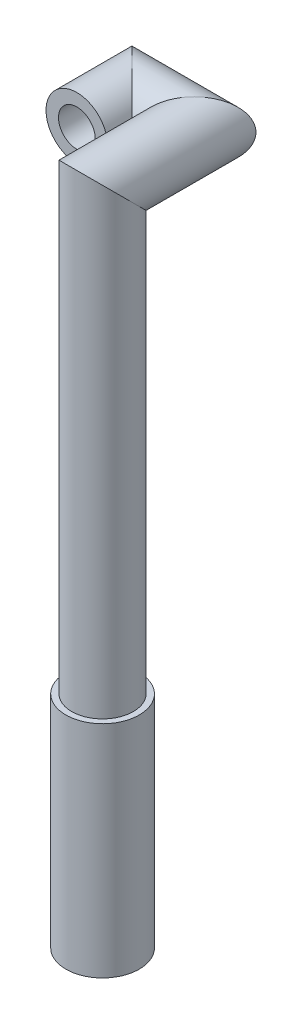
ISO-10303-21;
HEADER;
FILE_DESCRIPTION(('STEP AP214'),'2;1');
FILE_NAME('part.step','',(''),(''),'','','');
FILE_SCHEMA(('AUTOMOTIVE_DESIGN { 1 0 10303 214 1 1 1 1 }'));
ENDSEC;
DATA;
#1=APPLICATION_CONTEXT('core data for automotive mechanical design processes');
#2=APPLICATION_PROTOCOL_DEFINITION('international standard','automotive_design',2000,#1);
#3=PRODUCT_CONTEXT('',#1,'mechanical');
#4=PRODUCT('Part','Part','',(#3));
#5=PRODUCT_RELATED_PRODUCT_CATEGORY('part','',(#4));
#6=PRODUCT_DEFINITION_FORMATION('','',#4);
#7=PRODUCT_DEFINITION_CONTEXT('part definition',#1,'design');
#8=PRODUCT_DEFINITION('design','',#6,#7);
#9=PRODUCT_DEFINITION_SHAPE('','',#8);
#10=(LENGTH_UNIT() NAMED_UNIT(*) SI_UNIT(.MILLI.,.METRE.));
#11=(NAMED_UNIT(*) PLANE_ANGLE_UNIT() SI_UNIT($,.RADIAN.));
#12=(NAMED_UNIT(*) SI_UNIT($,.STERADIAN.) SOLID_ANGLE_UNIT());
#13=UNCERTAINTY_MEASURE_WITH_UNIT(LENGTH_MEASURE(1.E-05),#10,'distance_accuracy_value','');
#14=(GEOMETRIC_REPRESENTATION_CONTEXT(3) GLOBAL_UNCERTAINTY_ASSIGNED_CONTEXT((#13)) GLOBAL_UNIT_ASSIGNED_CONTEXT((#10,
#11,#12)) REPRESENTATION_CONTEXT('',''));
#15=CARTESIAN_POINT('',(0.,0.,0.));
#16=DIRECTION('',(0.,0.,1.));
#17=DIRECTION('',(1.,0.,0.));
#18=AXIS2_PLACEMENT_3D('',#15,#16,#17);
#19=CARTESIAN_POINT('',(0.,38.1,0.));
#20=DIRECTION('',(0.,-1.,0.));
#21=DIRECTION('',(0.,0.,-1.));
#22=AXIS2_PLACEMENT_3D('',#19,#20,#21);
#23=CYLINDRICAL_SURFACE('',#22,6.35);
#24=CARTESIAN_POINT('',(0.,-12.7,0.));
#25=DIRECTION('',(0.,-1.,0.));
#26=DIRECTION('',(0.,0.,-1.));
#27=AXIS2_PLACEMENT_3D('',#24,#25,#26);
#28=CIRCLE('',#27,6.35);
#29=CARTESIAN_POINT('',(0.,-12.7,-6.35));
#30=VERTEX_POINT('',#29);
#31=EDGE_CURVE('E35',#30,#30,#28,.T.);
#32=ORIENTED_EDGE('',*,*,#31,.T.);
#33=EDGE_LOOP('',(#32));
#34=FACE_BOUND('',#33,.T.);
#35=CARTESIAN_POINT('',(0.,190.5,0.));
#36=DIRECTION('',(0.,0.707106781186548,-0.707106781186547));
#37=DIRECTION('',(0.,0.707106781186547,0.707106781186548));
#38=AXIS2_PLACEMENT_3D('',#35,#36,#37);
#39=ELLIPSE('',#38,8.98025612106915,6.35);
#40=CARTESIAN_POINT('',(0.,196.85,6.35000000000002));
#41=VERTEX_POINT('',#40);
#42=EDGE_CURVE('E52',#41,#41,#39,.T.);
#43=ORIENTED_EDGE('',*,*,#42,.T.);
#44=EDGE_LOOP('',(#43));
#45=FACE_BOUND('',#44,.T.);
#46=ADVANCED_FACE('F31',(#34,#45),#23,.F.);
#47=CARTESIAN_POINT('',(0.,38.1,0.));
#48=DIRECTION('',(0.,1.,0.));
#49=DIRECTION('',(0.,0.,1.));
#50=AXIS2_PLACEMENT_3D('',#47,#48,#49);
#51=PLANE('',#50);
#52=CARTESIAN_POINT('',(0.,38.1,0.));
#53=DIRECTION('',(0.,1.,0.));
#54=DIRECTION('',(0.,0.,1.));
#55=AXIS2_PLACEMENT_3D('',#52,#53,#54);
#56=CIRCLE('',#55,10.668);
#57=CARTESIAN_POINT('',(0.,38.1,10.668));
#58=VERTEX_POINT('',#57);
#59=EDGE_CURVE('E39',#58,#58,#56,.T.);
#60=ORIENTED_EDGE('',*,*,#59,.F.);
#61=EDGE_LOOP('',(#60));
#62=FACE_BOUND('',#61,.T.);
#63=CARTESIAN_POINT('',(0.,38.1,0.));
#64=DIRECTION('',(0.,1.,0.));
#65=DIRECTION('',(0.,0.,1.));
#66=AXIS2_PLACEMENT_3D('',#63,#64,#65);
#67=CIRCLE('',#66,12.7);
#68=CARTESIAN_POINT('',(0.,38.1,-12.7));
#69=VERTEX_POINT('',#68);
#70=EDGE_CURVE('E10',#69,#69,#67,.T.);
#71=ORIENTED_EDGE('',*,*,#70,.T.);
#72=EDGE_LOOP('',(#71));
#73=FACE_BOUND('',#72,.T.);
#74=ADVANCED_FACE('F122',(#62,#73),#51,.T.);
#75=CARTESIAN_POINT('',(0.,38.1,0.));
#76=DIRECTION('',(0.,-1.,0.));
#77=DIRECTION('',(0.,0.,-1.));
#78=AXIS2_PLACEMENT_3D('',#75,#76,#77);
#79=CYLINDRICAL_SURFACE('',#78,12.7);
#80=CARTESIAN_POINT('',(0.,-38.1,0.));
#81=DIRECTION('',(0.,1.,0.));
#82=DIRECTION('',(0.,0.,1.));
#83=AXIS2_PLACEMENT_3D('',#80,#81,#82);
#84=CIRCLE('',#83,12.7);
#85=CARTESIAN_POINT('',(0.,-38.1,-12.7));
#86=VERTEX_POINT('',#85);
#87=EDGE_CURVE('E43',#86,#86,#84,.T.);
#88=CARTESIAN_POINT('',(0.,38.1,-12.7));
#89=CARTESIAN_POINT('',(0.,37.30625,-12.7));
#90=CARTESIAN_POINT('',(0.,36.5125,-12.7));
#91=CARTESIAN_POINT('',(0.,34.925,-12.7));
#92=CARTESIAN_POINT('',(0.,34.13125,-12.7));
#93=CARTESIAN_POINT('',(0.,32.54375,-12.7));
#94=CARTESIAN_POINT('',(0.,31.75,-12.7));
#95=CARTESIAN_POINT('',(0.,30.1625,-12.7));
#96=CARTESIAN_POINT('',(0.,29.36875,-12.7));
#97=CARTESIAN_POINT('',(0.,27.78125,-12.7));
#98=CARTESIAN_POINT('',(0.,26.9875,-12.7));
#99=CARTESIAN_POINT('',(0.,25.4,-12.7));
#100=CARTESIAN_POINT('',(0.,24.60625,-12.7));
#101=CARTESIAN_POINT('',(0.,23.01875,-12.7));
#102=CARTESIAN_POINT('',(0.,22.225,-12.7));
#103=CARTESIAN_POINT('',(0.,20.6375,-12.7));
#104=CARTESIAN_POINT('',(0.,19.84375,-12.7));
#105=CARTESIAN_POINT('',(0.,18.25625,-12.7));
#106=CARTESIAN_POINT('',(0.,17.4625,-12.7));
#107=CARTESIAN_POINT('',(0.,15.875,-12.7));
#108=CARTESIAN_POINT('',(0.,15.08125,-12.7));
#109=CARTESIAN_POINT('',(0.,13.49375,-12.7));
#110=CARTESIAN_POINT('',(0.,12.7,-12.7));
#111=CARTESIAN_POINT('',(0.,11.1125,-12.7));
#112=CARTESIAN_POINT('',(0.,10.31875,-12.7));
#113=CARTESIAN_POINT('',(0.,8.73124999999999,-12.7));
#114=CARTESIAN_POINT('',(0.,7.93749999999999,-12.7));
#115=CARTESIAN_POINT('',(0.,6.34999999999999,-12.7));
#116=CARTESIAN_POINT('',(0.,5.55625,-12.7));
#117=CARTESIAN_POINT('',(0.,3.96875,-12.7));
#118=CARTESIAN_POINT('',(0.,3.17499999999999,-12.7));
#119=CARTESIAN_POINT('',(0.,1.58749999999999,-12.7));
#120=CARTESIAN_POINT('',(0.,0.793749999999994,-12.7));
#121=CARTESIAN_POINT('',(0.,-0.793750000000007,-12.7));
#122=CARTESIAN_POINT('',(0.,-1.58750000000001,-12.7));
#123=CARTESIAN_POINT('',(0.,-3.17500000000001,-12.7));
#124=CARTESIAN_POINT('',(0.,-3.96875000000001,-12.7));
#125=CARTESIAN_POINT('',(0.,-5.55625000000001,-12.7));
#126=CARTESIAN_POINT('',(0.,-6.35000000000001,-12.7));
#127=CARTESIAN_POINT('',(0.,-7.93750000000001,-12.7));
#128=CARTESIAN_POINT('',(0.,-8.73125000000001,-12.7));
#129=CARTESIAN_POINT('',(0.,-10.31875,-12.7));
#130=CARTESIAN_POINT('',(0.,-11.1125,-12.7));
#131=CARTESIAN_POINT('',(0.,-12.7,-12.7));
#132=CARTESIAN_POINT('',(0.,-13.49375,-12.7));
#133=CARTESIAN_POINT('',(0.,-15.08125,-12.7));
#134=CARTESIAN_POINT('',(0.,-15.875,-12.7));
#135=CARTESIAN_POINT('',(0.,-17.4625,-12.7));
#136=CARTESIAN_POINT('',(0.,-18.25625,-12.7));
#137=CARTESIAN_POINT('',(0.,-19.84375,-12.7));
#138=CARTESIAN_POINT('',(0.,-20.6375,-12.7));
#139=CARTESIAN_POINT('',(0.,-22.225,-12.7));
#140=CARTESIAN_POINT('',(0.,-23.01875,-12.7));
#141=CARTESIAN_POINT('',(0.,-24.60625,-12.7));
#142=CARTESIAN_POINT('',(0.,-25.4,-12.7));
#143=CARTESIAN_POINT('',(0.,-26.9875,-12.7));
#144=CARTESIAN_POINT('',(0.,-27.78125,-12.7));
#145=CARTESIAN_POINT('',(0.,-29.36875,-12.7));
#146=CARTESIAN_POINT('',(0.,-30.1625,-12.7));
#147=CARTESIAN_POINT('',(0.,-31.75,-12.7));
#148=CARTESIAN_POINT('',(0.,-32.54375,-12.7));
#149=CARTESIAN_POINT('',(0.,-34.13125,-12.7));
#150=CARTESIAN_POINT('',(0.,-34.925,-12.7));
#151=CARTESIAN_POINT('',(0.,-36.5125,-12.7));
#152=CARTESIAN_POINT('',(0.,-37.30625,-12.7));
#153=CARTESIAN_POINT('',(0.,-38.1,-12.7));
#154=B_SPLINE_CURVE_WITH_KNOTS('',3,(#88,#89,#90,#91,#92,#93,#94,#95,#96,#97,#98,#99,#100,#101,
#102,#103,#104,#105,#106,#107,#108,#109,#110,#111,#112,#113,#114,#115,#116,#117,#118,#119,#120,
#121,#122,#123,#124,#125,#126,#127,#128,#129,#130,#131,#132,#133,#134,#135,#136,#137,#138,#139,
#140,#141,#142,#143,#144,#145,#146,#147,#148,#149,#150,#151,#152,#153),.UNSPECIFIED.,.F.,.F.,(4,
2,2,2,2,2,2,2,2,2,2,2,2,2,2,2,2,2,2,2,2,2,2,2,2,2,2,2,2,2,2,2,4),(0.,2.38124999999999,4.7625,
7.14375,9.525,11.90625,14.2875,16.66875,19.05,21.43125,23.8125,26.19375,28.575,30.95625,33.3375,
35.71875,38.1,40.48125,42.8625,45.24375,47.625,50.00625,52.3875,54.76875,57.15,59.53125,61.9125,
64.29375,66.675,69.05625,71.4375,73.81875,76.2),.UNSPECIFIED.);
#155=EDGE_CURVE('BSEAM33',#69,#86,#154,.T.);
#156=ORIENTED_EDGE('',*,*,#70,.F.);
#157=ORIENTED_EDGE('',*,*,#87,.T.);
#158=ORIENTED_EDGE('',*,*,#155,.T.);
#159=ORIENTED_EDGE('',*,*,#155,.F.);
#160=EDGE_LOOP('',(#156,#158,#157,#159));
#161=FACE_BOUND('',#160,.T.);
#162=ADVANCED_FACE('F33',(#161),#79,.T.);
#163=CARTESIAN_POINT('',(0.,-38.1,0.));
#164=DIRECTION('',(0.,-1.,0.));
#165=DIRECTION('',(0.,0.,1.));
#166=AXIS2_PLACEMENT_3D('',#163,#164,#165);
#167=PLANE('',#166);
#168=CARTESIAN_POINT('',(0.,-38.1,0.));
#169=DIRECTION('',(0.,1.,0.));
#170=DIRECTION('',(0.,0.,1.));
#171=AXIS2_PLACEMENT_3D('',#168,#169,#170);
#172=CIRCLE('',#171,10.668);
#173=CARTESIAN_POINT('',(0.,-38.1,10.668));
#174=VERTEX_POINT('',#173);
#175=EDGE_CURVE('E48',#174,#174,#172,.T.);
#176=ORIENTED_EDGE('',*,*,#175,.T.);
#177=EDGE_LOOP('',(#176));
#178=FACE_BOUND('',#177,.T.);
#179=ORIENTED_EDGE('',*,*,#87,.F.);
#180=EDGE_LOOP('',(#179));
#181=FACE_BOUND('',#180,.T.);
#182=ADVANCED_FACE('F132',(#178,#181),#167,.T.);
#183=CARTESIAN_POINT('',(0.,-12.7,0.));
#184=DIRECTION('',(0.,-1.,0.));
#185=DIRECTION('',(0.,0.,-1.));
#186=AXIS2_PLACEMENT_3D('',#183,#184,#185);
#187=CYLINDRICAL_SURFACE('',#186,10.668);
#188=CARTESIAN_POINT('',(0.,-12.7,0.));
#189=DIRECTION('',(0.,1.,0.));
#190=DIRECTION('',(0.,0.,1.));
#191=AXIS2_PLACEMENT_3D('',#188,#189,#190);
#192=CIRCLE('',#191,10.668);
#193=CARTESIAN_POINT('',(0.,-12.7,10.668));
#194=VERTEX_POINT('',#193);
#195=EDGE_CURVE('E51',#194,#194,#192,.T.);
#196=ORIENTED_EDGE('',*,*,#195,.T.);
#197=EDGE_LOOP('',(#196));
#198=FACE_BOUND('',#197,.T.);
#199=ORIENTED_EDGE('',*,*,#175,.F.);
#200=EDGE_LOOP('',(#199));
#201=FACE_BOUND('',#200,.T.);
#202=ADVANCED_FACE('F135',(#198,#201),#187,.F.);
#203=CARTESIAN_POINT('',(0.,-12.7,0.));
#204=DIRECTION('',(0.,-1.,0.));
#205=DIRECTION('',(0.,0.,1.));
#206=AXIS2_PLACEMENT_3D('',#203,#204,#205);
#207=PLANE('',#206);
#208=ORIENTED_EDGE('',*,*,#31,.F.);
#209=EDGE_LOOP('',(#208));
#210=FACE_BOUND('',#209,.T.);
#211=ORIENTED_EDGE('',*,*,#195,.F.);
#212=EDGE_LOOP('',(#211));
#213=FACE_BOUND('',#212,.T.);
#214=ADVANCED_FACE('F117',(#210,#213),#207,.T.);
#215=CARTESIAN_POINT('',(0.,-17.4736605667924,0.));
#216=DIRECTION('',(0.,1.,0.));
#217=DIRECTION('',(0.,0.,1.));
#218=AXIS2_PLACEMENT_3D('',#215,#216,#217);
#219=CYLINDRICAL_SURFACE('',#218,10.668);
#220=ORIENTED_EDGE('',*,*,#59,.T.);
#221=EDGE_LOOP('',(#220));
#222=FACE_BOUND('',#221,.T.);
#223=CARTESIAN_POINT('',(0.,190.5,0.));
#224=DIRECTION('',(0.,0.707106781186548,-0.707106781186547));
#225=DIRECTION('',(0.,0.707106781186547,0.707106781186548));
#226=AXIS2_PLACEMENT_3D('',#223,#224,#225);
#227=ELLIPSE('',#226,15.0868302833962,10.668);
#228=CARTESIAN_POINT('',(0.,201.168,10.668));
#229=VERTEX_POINT('',#228);
#230=EDGE_CURVE('E61',#229,#229,#227,.F.);
#231=ORIENTED_EDGE('',*,*,#230,.T.);
#232=EDGE_LOOP('',(#231));
#233=FACE_BOUND('',#232,.T.);
#234=ADVANCED_FACE('F85',(#222,#233),#219,.T.);
#235=CARTESIAN_POINT('',(-21.59,190.5,-55.3196));
#236=DIRECTION('',(0.,0.,1.));
#237=DIRECTION('',(1.,0.,0.));
#238=AXIS2_PLACEMENT_3D('',#235,#236,#237);
#239=CYLINDRICAL_SURFACE('',#238,10.668);
#240=CARTESIAN_POINT('',(-21.59,190.5,-31.75));
#241=DIRECTION('',(-0.707106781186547,0.,0.707106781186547));
#242=DIRECTION('',(-0.707106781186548,0.,-0.707106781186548));
#243=AXIS2_PLACEMENT_3D('',#240,#241,#242);
#244=ELLIPSE('',#243,15.0868302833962,10.668);
#245=CARTESIAN_POINT('',(-32.258,190.5,-42.418));
#246=VERTEX_POINT('',#245);
#247=EDGE_CURVE('E55',#246,#246,#244,.F.);
#248=ORIENTED_EDGE('',*,*,#247,.F.);
#249=EDGE_LOOP('',(#248));
#250=FACE_BOUND('',#249,.T.);
#251=CARTESIAN_POINT('',(-21.59,190.5,-12.7));
#252=DIRECTION('',(0.,0.,1.));
#253=DIRECTION('',(0.,1.,0.));
#254=AXIS2_PLACEMENT_3D('',#251,#252,#253);
#255=CIRCLE('',#254,10.668);
#256=CARTESIAN_POINT('',(-21.59,201.168,-12.7));
#257=VERTEX_POINT('',#256);
#258=EDGE_CURVE('E64',#257,#257,#255,.T.);
#259=ORIENTED_EDGE('',*,*,#258,.F.);
#260=EDGE_LOOP('',(#259));
#261=FACE_BOUND('',#260,.T.);
#262=ADVANCED_FACE('F106',(#250,#261),#239,.T.);
#263=CARTESIAN_POINT('',(23.5696,190.5,-31.75));
#264=DIRECTION('',(-1.,0.,0.));
#265=DIRECTION('',(0.,0.,1.));
#266=AXIS2_PLACEMENT_3D('',#263,#264,#265);
#267=CYLINDRICAL_SURFACE('',#266,10.668);
#268=CARTESIAN_POINT('',(0.,190.5,-31.75));
#269=DIRECTION('',(-0.707106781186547,0.,-0.707106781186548));
#270=DIRECTION('',(0.707106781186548,0.,-0.707106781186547));
#271=AXIS2_PLACEMENT_3D('',#268,#269,#270);
#272=ELLIPSE('',#271,15.0868302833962,10.668);
#273=CARTESIAN_POINT('',(10.668,190.5,-42.418));
#274=VERTEX_POINT('',#273);
#275=EDGE_CURVE('E58',#274,#274,#272,.F.);
#276=ORIENTED_EDGE('',*,*,#275,.F.);
#277=EDGE_LOOP('',(#276));
#278=FACE_BOUND('',#277,.T.);
#279=ORIENTED_EDGE('',*,*,#247,.T.);
#280=EDGE_LOOP('',(#279));
#281=FACE_BOUND('',#280,.T.);
#282=ADVANCED_FACE('F108',(#278,#281),#267,.T.);
#283=CARTESIAN_POINT('',(0.,190.5,11.8348));
#284=DIRECTION('',(0.,0.,-1.));
#285=DIRECTION('',(-1.,0.,0.));
#286=AXIS2_PLACEMENT_3D('',#283,#284,#285);
#287=CYLINDRICAL_SURFACE('',#286,10.668);
#288=ORIENTED_EDGE('',*,*,#230,.F.);
#289=EDGE_LOOP('',(#288));
#290=FACE_BOUND('',#289,.T.);
#291=ORIENTED_EDGE('',*,*,#275,.T.);
#292=EDGE_LOOP('',(#291));
#293=FACE_BOUND('',#292,.T.);
#294=ADVANCED_FACE('F102',(#290,#293),#287,.T.);
#295=CARTESIAN_POINT('',(-21.59,190.5,-12.7));
#296=DIRECTION('',(0.,0.,1.));
#297=DIRECTION('',(0.,1.,0.));
#298=AXIS2_PLACEMENT_3D('',#295,#296,#297);
#299=PLANE('',#298);
#300=CARTESIAN_POINT('',(-21.59,190.5,-12.7));
#301=DIRECTION('',(0.,0.,1.));
#302=DIRECTION('',(0.,1.,0.));
#303=AXIS2_PLACEMENT_3D('',#300,#301,#302);
#304=CIRCLE('',#303,6.35);
#305=CARTESIAN_POINT('',(-21.59,196.85,-12.7));
#306=VERTEX_POINT('',#305);
#307=EDGE_CURVE('E67',#306,#306,#304,.F.);
#308=ORIENTED_EDGE('',*,*,#307,.T.);
#309=EDGE_LOOP('',(#308));
#310=FACE_BOUND('',#309,.T.);
#311=ORIENTED_EDGE('',*,*,#258,.T.);
#312=EDGE_LOOP('',(#311));
#313=FACE_BOUND('',#312,.T.);
#314=ADVANCED_FACE('F96',(#310,#313),#299,.T.);
#315=CARTESIAN_POINT('',(-21.59,190.5,-45.82));
#316=DIRECTION('',(0.,0.,1.));
#317=DIRECTION('',(1.,0.,0.));
#318=AXIS2_PLACEMENT_3D('',#315,#316,#317);
#319=CYLINDRICAL_SURFACE('',#318,6.35);
#320=CARTESIAN_POINT('',(-21.59,190.5,-31.75));
#321=DIRECTION('',(-0.707106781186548,0.,0.707106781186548));
#322=DIRECTION('',(-0.707106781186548,0.,-0.707106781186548));
#323=AXIS2_PLACEMENT_3D('',#320,#321,#322);
#324=ELLIPSE('',#323,8.98025612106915,6.35);
#325=CARTESIAN_POINT('',(-27.94,190.5,-38.1));
#326=VERTEX_POINT('',#325);
#327=EDGE_CURVE('E70',#326,#326,#324,.T.);
#328=ORIENTED_EDGE('',*,*,#327,.F.);
#329=EDGE_LOOP('',(#328));
#330=FACE_BOUND('',#329,.T.);
#331=ORIENTED_EDGE('',*,*,#307,.F.);
#332=EDGE_LOOP('',(#331));
#333=FACE_BOUND('',#332,.T.);
#334=ADVANCED_FACE('F90',(#330,#333),#319,.F.);
#335=CARTESIAN_POINT('',(14.07,190.5,-31.75));
#336=DIRECTION('',(-1.,0.,0.));
#337=DIRECTION('',(0.,0.,1.));
#338=AXIS2_PLACEMENT_3D('',#335,#336,#337);
#339=CYLINDRICAL_SURFACE('',#338,6.35);
#340=CARTESIAN_POINT('',(0.,190.5,-31.75));
#341=DIRECTION('',(-0.707106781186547,0.,-0.707106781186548));
#342=DIRECTION('',(0.707106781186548,0.,-0.707106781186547));
#343=AXIS2_PLACEMENT_3D('',#340,#341,#342);
#344=ELLIPSE('',#343,8.98025612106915,6.35);
#345=CARTESIAN_POINT('',(6.34999999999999,190.5,-38.1));
#346=VERTEX_POINT('',#345);
#347=EDGE_CURVE('E73',#346,#346,#344,.T.);
#348=ORIENTED_EDGE('',*,*,#347,.F.);
#349=EDGE_LOOP('',(#348));
#350=FACE_BOUND('',#349,.T.);
#351=ORIENTED_EDGE('',*,*,#327,.T.);
#352=EDGE_LOOP('',(#351));
#353=FACE_BOUND('',#352,.T.);
#354=ADVANCED_FACE('F83',(#350,#353),#339,.F.);
#355=CARTESIAN_POINT('',(0.,190.5,7.08500000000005));
#356=DIRECTION('',(0.,0.,-1.));
#357=DIRECTION('',(-1.,0.,0.));
#358=AXIS2_PLACEMENT_3D('',#355,#356,#357);
#359=CYLINDRICAL_SURFACE('',#358,6.35);
#360=ORIENTED_EDGE('',*,*,#42,.F.);
#361=EDGE_LOOP('',(#360));
#362=FACE_BOUND('',#361,.T.);
#363=ORIENTED_EDGE('',*,*,#347,.T.);
#364=EDGE_LOOP('',(#363));
#365=FACE_BOUND('',#364,.T.);
#366=ADVANCED_FACE('F80',(#362,#365),#359,.F.);
#367=CLOSED_SHELL('',(#46,#74,#162,#182,#202,#214,#234,#262,#282,#294,#314,#334,#354,#366));
#368=MANIFOLD_SOLID_BREP('B2',#367);
#369=ADVANCED_BREP_SHAPE_REPRESENTATION('',(#18,#368),#14);
#370=SHAPE_DEFINITION_REPRESENTATION(#9,#369);
ENDSEC;
END-ISO-10303-21;
